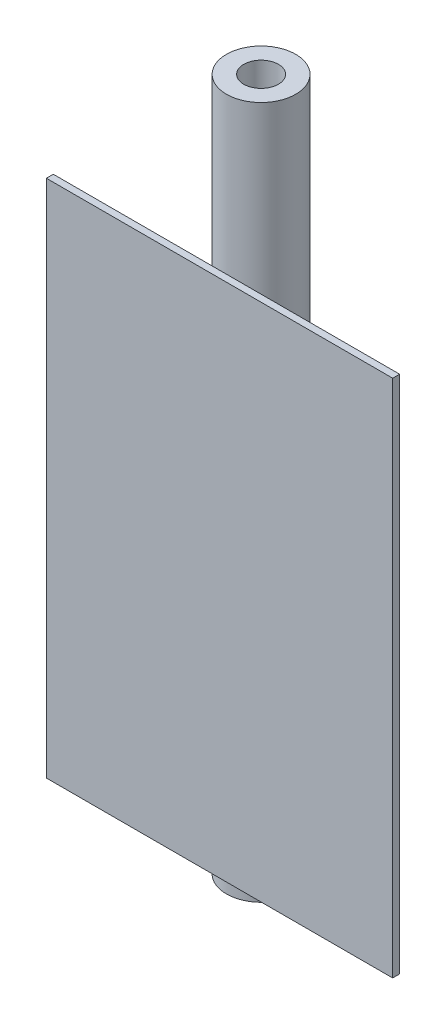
ISO-10303-21;
HEADER;
FILE_DESCRIPTION(('STEP AP214'),'2;1');
FILE_NAME('part.step','',(''),(''),'','','');
FILE_SCHEMA(('AUTOMOTIVE_DESIGN { 1 0 10303 214 1 1 1 1 }'));
ENDSEC;
DATA;
#1=APPLICATION_CONTEXT('core data for automotive mechanical design processes');
#2=APPLICATION_PROTOCOL_DEFINITION('international standard','automotive_design',2000,#1);
#3=PRODUCT_CONTEXT('',#1,'mechanical');
#4=PRODUCT('Part','Part','',(#3));
#5=PRODUCT_RELATED_PRODUCT_CATEGORY('part','',(#4));
#6=PRODUCT_DEFINITION_FORMATION('','',#4);
#7=PRODUCT_DEFINITION_CONTEXT('part definition',#1,'design');
#8=PRODUCT_DEFINITION('design','',#6,#7);
#9=PRODUCT_DEFINITION_SHAPE('','',#8);
#10=(LENGTH_UNIT() NAMED_UNIT(*) SI_UNIT(.MILLI.,.METRE.));
#11=(NAMED_UNIT(*) PLANE_ANGLE_UNIT() SI_UNIT($,.RADIAN.));
#12=(NAMED_UNIT(*) SI_UNIT($,.STERADIAN.) SOLID_ANGLE_UNIT());
#13=UNCERTAINTY_MEASURE_WITH_UNIT(LENGTH_MEASURE(1.E-05),#10,'distance_accuracy_value','');
#14=(GEOMETRIC_REPRESENTATION_CONTEXT(3) GLOBAL_UNCERTAINTY_ASSIGNED_CONTEXT((#13)) GLOBAL_UNIT_ASSIGNED_CONTEXT((#10,
#11,#12)) REPRESENTATION_CONTEXT('',''));
#15=CARTESIAN_POINT('',(0.,0.,0.));
#16=DIRECTION('',(0.,0.,1.));
#17=DIRECTION('',(1.,0.,0.));
#18=AXIS2_PLACEMENT_3D('',#15,#16,#17);
#19=CARTESIAN_POINT('',(-50.,5.,12.));
#20=DIRECTION('',(1.,0.,0.));
#21=DIRECTION('',(0.,0.,-1.));
#22=AXIS2_PLACEMENT_3D('',#19,#20,#21);
#23=PLANE('',#22);
#24=DIRECTION('',(0.,-1.,0.));
#25=VECTOR('',#24,1.);
#26=CARTESIAN_POINT('',(-50.,5.,9.99999999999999));
#27=LINE('',#26,#25);
#28=CARTESIAN_POINT('',(-50.,155.,9.99999999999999));
#29=VERTEX_POINT('',#28);
#30=CARTESIAN_POINT('',(-50.,5.,9.99999999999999));
#31=VERTEX_POINT('',#30);
#32=EDGE_CURVE('E104',#29,#31,#27,.T.);
#33=ORIENTED_EDGE('',*,*,#32,.T.);
#34=DIRECTION('',(0.,0.,-1.));
#35=VECTOR('',#34,1.);
#36=CARTESIAN_POINT('',(-50.,5.,12.));
#37=LINE('',#36,#35);
#38=CARTESIAN_POINT('',(-50.,5.,12.));
#39=VERTEX_POINT('',#38);
#40=EDGE_CURVE('E12',#39,#31,#37,.T.);
#41=ORIENTED_EDGE('',*,*,#40,.F.);
#42=DIRECTION('',(0.,-1.,0.));
#43=VECTOR('',#42,1.);
#44=CARTESIAN_POINT('',(-50.,5.,12.));
#45=LINE('',#44,#43);
#46=CARTESIAN_POINT('',(-50.,155.,12.));
#47=VERTEX_POINT('',#46);
#48=EDGE_CURVE('E92',#47,#39,#45,.T.);
#49=ORIENTED_EDGE('',*,*,#48,.F.);
#50=DIRECTION('',(0.,0.,-1.));
#51=VECTOR('',#50,1.);
#52=CARTESIAN_POINT('',(-50.,155.,12.));
#53=LINE('',#52,#51);
#54=EDGE_CURVE('E100',#47,#29,#53,.T.);
#55=ORIENTED_EDGE('',*,*,#54,.T.);
#56=EDGE_LOOP('',(#33,#41,#49,#55));
#57=FACE_BOUND('',#56,.T.);
#58=ADVANCED_FACE('F41',(#57),#23,.F.);
#59=CARTESIAN_POINT('',(-50.,5.,12.));
#60=DIRECTION('',(0.,1.,0.));
#61=DIRECTION('',(0.,0.,1.));
#62=AXIS2_PLACEMENT_3D('',#59,#60,#61);
#63=PLANE('',#62);
#64=DIRECTION('',(1.,0.,0.));
#65=VECTOR('',#64,1.);
#66=CARTESIAN_POINT('',(-50.,5.,9.99999999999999));
#67=LINE('',#66,#65);
#68=CARTESIAN_POINT('',(50.,5.,9.99999999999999));
#69=VERTEX_POINT('',#68);
#70=EDGE_CURVE('E96',#31,#69,#67,.T.);
#71=ORIENTED_EDGE('',*,*,#70,.T.);
#72=DIRECTION('',(0.,0.,-1.));
#73=VECTOR('',#72,1.);
#74=CARTESIAN_POINT('',(50.,5.,12.));
#75=LINE('',#74,#73);
#76=CARTESIAN_POINT('',(50.,5.,12.));
#77=VERTEX_POINT('',#76);
#78=EDGE_CURVE('E49',#77,#69,#75,.T.);
#79=ORIENTED_EDGE('',*,*,#78,.F.);
#80=DIRECTION('',(1.,0.,0.));
#81=VECTOR('',#80,1.);
#82=CARTESIAN_POINT('',(-50.,5.,12.));
#83=LINE('',#82,#81);
#84=EDGE_CURVE('E87',#39,#77,#83,.T.);
#85=ORIENTED_EDGE('',*,*,#84,.F.);
#86=ORIENTED_EDGE('',*,*,#40,.T.);
#87=EDGE_LOOP('',(#71,#79,#85,#86));
#88=FACE_BOUND('',#87,.T.);
#89=ADVANCED_FACE('F95',(#88),#63,.F.);
#90=CARTESIAN_POINT('',(50.,5.,12.));
#91=DIRECTION('',(-1.,0.,0.));
#92=DIRECTION('',(0.,0.,1.));
#93=AXIS2_PLACEMENT_3D('',#90,#91,#92);
#94=PLANE('',#93);
#95=DIRECTION('',(0.,1.,0.));
#96=VECTOR('',#95,1.);
#97=CARTESIAN_POINT('',(50.,5.,9.99999999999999));
#98=LINE('',#97,#96);
#99=CARTESIAN_POINT('',(50.,155.,9.99999999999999));
#100=VERTEX_POINT('',#99);
#101=EDGE_CURVE('E74',#69,#100,#98,.T.);
#102=ORIENTED_EDGE('',*,*,#101,.T.);
#103=DIRECTION('',(0.,0.,-1.));
#104=VECTOR('',#103,1.);
#105=CARTESIAN_POINT('',(50.,155.,12.));
#106=LINE('',#105,#104);
#107=CARTESIAN_POINT('',(50.,155.,12.));
#108=VERTEX_POINT('',#107);
#109=EDGE_CURVE('E97',#108,#100,#106,.T.);
#110=ORIENTED_EDGE('',*,*,#109,.F.);
#111=DIRECTION('',(0.,1.,0.));
#112=VECTOR('',#111,1.);
#113=CARTESIAN_POINT('',(50.,5.,12.));
#114=LINE('',#113,#112);
#115=EDGE_CURVE('E90',#77,#108,#114,.T.);
#116=ORIENTED_EDGE('',*,*,#115,.F.);
#117=ORIENTED_EDGE('',*,*,#78,.T.);
#118=EDGE_LOOP('',(#102,#110,#116,#117));
#119=FACE_BOUND('',#118,.T.);
#120=ADVANCED_FACE('F98',(#119),#94,.F.);
#121=CARTESIAN_POINT('',(-50.,155.,12.));
#122=DIRECTION('',(0.,-1.,0.));
#123=DIRECTION('',(0.,0.,-1.));
#124=AXIS2_PLACEMENT_3D('',#121,#122,#123);
#125=PLANE('',#124);
#126=DIRECTION('',(-1.,0.,0.));
#127=VECTOR('',#126,1.);
#128=CARTESIAN_POINT('',(-50.,155.,9.99999999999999));
#129=LINE('',#128,#127);
#130=EDGE_CURVE('E80',#100,#29,#129,.T.);
#131=ORIENTED_EDGE('',*,*,#130,.T.);
#132=ORIENTED_EDGE('',*,*,#54,.F.);
#133=DIRECTION('',(-1.,0.,0.));
#134=VECTOR('',#133,1.);
#135=CARTESIAN_POINT('',(-50.,155.,12.));
#136=LINE('',#135,#134);
#137=EDGE_CURVE('E57',#108,#47,#136,.T.);
#138=ORIENTED_EDGE('',*,*,#137,.F.);
#139=ORIENTED_EDGE('',*,*,#109,.T.);
#140=EDGE_LOOP('',(#131,#132,#138,#139));
#141=FACE_BOUND('',#140,.T.);
#142=ADVANCED_FACE('F111',(#141),#125,.F.);
#143=CARTESIAN_POINT('',(0.,0.,12.));
#144=DIRECTION('',(0.,0.,-1.));
#145=DIRECTION('',(-1.,0.,0.));
#146=AXIS2_PLACEMENT_3D('',#143,#144,#145);
#147=PLANE('',#146);
#148=ORIENTED_EDGE('',*,*,#48,.T.);
#149=ORIENTED_EDGE('',*,*,#84,.T.);
#150=ORIENTED_EDGE('',*,*,#115,.T.);
#151=ORIENTED_EDGE('',*,*,#137,.T.);
#152=EDGE_LOOP('',(#148,#149,#150,#151));
#153=FACE_BOUND('',#152,.T.);
#154=ADVANCED_FACE('F88',(#153),#147,.F.);
#155=CARTESIAN_POINT('',(0.,0.,9.99999999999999));
#156=DIRECTION('',(0.,0.,-1.));
#157=DIRECTION('',(-1.,0.,0.));
#158=AXIS2_PLACEMENT_3D('',#155,#156,#157);
#159=PLANE('',#158);
#160=ORIENTED_EDGE('',*,*,#32,.F.);
#161=ORIENTED_EDGE('',*,*,#130,.F.);
#162=ORIENTED_EDGE('',*,*,#101,.F.);
#163=ORIENTED_EDGE('',*,*,#70,.F.);
#164=EDGE_LOOP('',(#160,#161,#162,#163));
#165=FACE_BOUND('',#164,.T.);
#166=ADVANCED_FACE('F114',(#165),#159,.T.);
#167=CLOSED_SHELL('',(#58,#89,#120,#142,#154,#166));
#168=MANIFOLD_SOLID_BREP('B2',#167);
#169=CARTESIAN_POINT('',(0.,200.,0.));
#170=DIRECTION('',(0.,1.,0.));
#171=DIRECTION('',(0.,0.,1.));
#172=AXIS2_PLACEMENT_3D('',#169,#170,#171);
#173=PLANE('',#172);
#174=CARTESIAN_POINT('',(0.,200.,0.));
#175=DIRECTION('',(0.,1.,0.));
#176=DIRECTION('',(0.,0.,1.));
#177=AXIS2_PLACEMENT_3D('',#174,#175,#176);
#178=CIRCLE('',#177,10.);
#179=CARTESIAN_POINT('',(0.,200.,10.));
#180=VERTEX_POINT('',#179);
#181=EDGE_CURVE('E40',#180,#180,#178,.T.);
#182=ORIENTED_EDGE('',*,*,#181,.T.);
#183=EDGE_LOOP('',(#182));
#184=FACE_BOUND('',#183,.T.);
#185=CARTESIAN_POINT('',(0.,200.,0.));
#186=DIRECTION('',(0.,1.,0.));
#187=DIRECTION('',(0.,0.,1.));
#188=AXIS2_PLACEMENT_3D('',#185,#186,#187);
#189=CIRCLE('',#188,5.);
#190=CARTESIAN_POINT('',(0.,200.,5.));
#191=VERTEX_POINT('',#190);
#192=EDGE_CURVE('E176',#191,#191,#189,.T.);
#193=ORIENTED_EDGE('',*,*,#192,.F.);
#194=EDGE_LOOP('',(#193));
#195=FACE_BOUND('',#194,.T.);
#196=ADVANCED_FACE('F165',(#184,#195),#173,.T.);
#197=CARTESIAN_POINT('',(0.,0.,0.));
#198=DIRECTION('',(0.,1.,0.));
#199=DIRECTION('',(0.,0.,1.));
#200=AXIS2_PLACEMENT_3D('',#197,#198,#199);
#201=PLANE('',#200);
#202=CARTESIAN_POINT('',(0.,0.,0.));
#203=DIRECTION('',(0.,1.,0.));
#204=DIRECTION('',(0.,0.,1.));
#205=AXIS2_PLACEMENT_3D('',#202,#203,#204);
#206=CIRCLE('',#205,10.);
#207=CARTESIAN_POINT('',(0.,0.,10.));
#208=VERTEX_POINT('',#207);
#209=EDGE_CURVE('E169',#208,#208,#206,.T.);
#210=ORIENTED_EDGE('',*,*,#209,.F.);
#211=EDGE_LOOP('',(#210));
#212=FACE_BOUND('',#211,.T.);
#213=CARTESIAN_POINT('',(0.,0.,0.));
#214=DIRECTION('',(0.,1.,0.));
#215=DIRECTION('',(0.,0.,1.));
#216=AXIS2_PLACEMENT_3D('',#213,#214,#215);
#217=CIRCLE('',#216,5.);
#218=CARTESIAN_POINT('',(0.,0.,5.));
#219=VERTEX_POINT('',#218);
#220=EDGE_CURVE('E178',#219,#219,#217,.T.);
#221=ORIENTED_EDGE('',*,*,#220,.T.);
#222=EDGE_LOOP('',(#221));
#223=FACE_BOUND('',#222,.T.);
#224=ADVANCED_FACE('F188',(#212,#223),#201,.F.);
#225=CARTESIAN_POINT('',(0.,200.,0.));
#226=DIRECTION('',(0.,-1.,0.));
#227=DIRECTION('',(0.,0.,-1.));
#228=AXIS2_PLACEMENT_3D('',#225,#226,#227);
#229=CYLINDRICAL_SURFACE('',#228,10.);
#230=ORIENTED_EDGE('',*,*,#181,.F.);
#231=EDGE_LOOP('',(#230));
#232=FACE_BOUND('',#231,.T.);
#233=ORIENTED_EDGE('',*,*,#209,.T.);
#234=EDGE_LOOP('',(#233));
#235=FACE_BOUND('',#234,.T.);
#236=ADVANCED_FACE('F167',(#232,#235),#229,.T.);
#237=CARTESIAN_POINT('',(0.,200.,0.));
#238=DIRECTION('',(0.,-1.,0.));
#239=DIRECTION('',(0.,0.,-1.));
#240=AXIS2_PLACEMENT_3D('',#237,#238,#239);
#241=CYLINDRICAL_SURFACE('',#240,5.);
#242=ORIENTED_EDGE('',*,*,#192,.T.);
#243=EDGE_LOOP('',(#242));
#244=FACE_BOUND('',#243,.T.);
#245=ORIENTED_EDGE('',*,*,#220,.F.);
#246=EDGE_LOOP('',(#245));
#247=FACE_BOUND('',#246,.T.);
#248=ADVANCED_FACE('F184',(#244,#247),#241,.F.);
#249=CLOSED_SHELL('',(#196,#224,#236,#248));
#250=MANIFOLD_SOLID_BREP('B6',#249);
#251=ADVANCED_BREP_SHAPE_REPRESENTATION('',(#18,#168,#250),#14);
#252=SHAPE_DEFINITION_REPRESENTATION(#9,#251);
ENDSEC;
END-ISO-10303-21;
